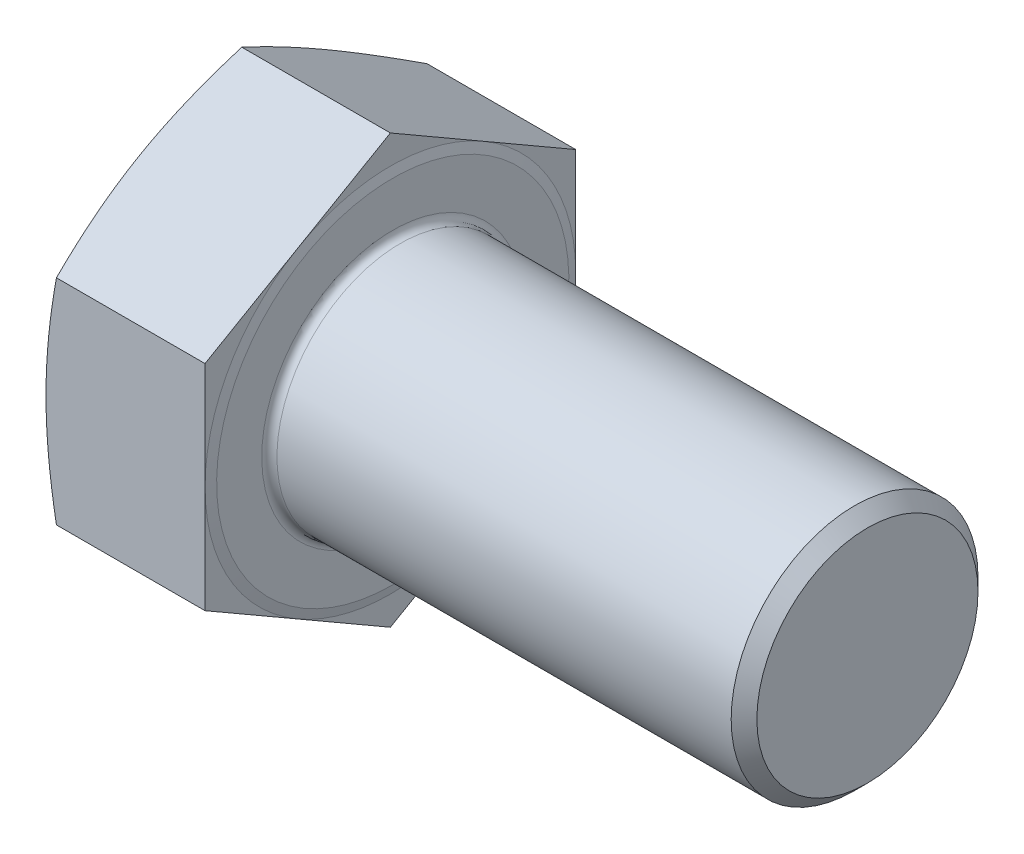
from build123d import *

# Parameters (mm, degrees)
BASEHEAD_DEPTH = 33.5
SKETCH3_R      = 26
BASEBODY_DEPTH = 100
CHAMFER1_SIZE  = 2.7065
HEADFILLET_R   = 1.6


with BuildPart() as part:
    # Sketch-BaseHead → BaseHead (new body)
    with BuildSketch(Plane(origin=(0, 0, 0), x_dir=(0, 0, -1), z_dir=(1, 0, 0))):
        Polygon((0, -45.091056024), (39.05, -22.545528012), (39.05, 22.545528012), (0, 45.091056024), (-39.05, 22.545528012), (-39.05, -22.545528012), align=None)
    extrude(amount=BASEHEAD_DEPTH)

    # Sketch4 → HeadChamfer (revolve, cut)
    with BuildSketch(Plane(origin=(-0.264637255, -5.916896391, 0), x_dir=(0, 1, 0), z_dir=(0, 0, 1))):
        Polygon((51.007952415, -0.264637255), (44.966896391, -0.264637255), (51.007952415, -2.463401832), align=None)
    revolve(axis=Axis((-4.001564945, 0, 0), (1, 0, 0)), mode=Mode.SUBTRACT)

    # Sketch1 → Revolve1 (revolve)
    with BuildSketch(Plane(origin=(0, 0, 0), x_dir=(1, 0, 0), z_dir=(0, 1, 0)), mode=Mode.PRIVATE) as revolve1_sk:
        Polygon((33.5, 0), (34, 0), (34, 37.1), (33.5, 39.05), align=None)
    revolve(revolve1_sk.sketch.rotate(Axis((-4.001564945, 0, 0), (1, 0, 0)), 270), axis=Axis((-4.001564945, 0, 0), (1, 0, 0)))

    # Sketch3 → BaseBody (add)
    with BuildSketch(Plane(origin=(34, 0, 0), x_dir=(0, 0, -1), z_dir=(1, 0, 0))):
        with Locations(Location((0, 0, 0), (0, 0, 270))):
            Circle(SKETCH3_R)
    extrude(amount=BASEBODY_DEPTH)

    # Chamfer1
    chamfer1_edges = [part.edges().sort_by_distance(p)[0] for p in [
        (134, 26, 0),
    ]]
    chamfer(chamfer1_edges, length=CHAMFER1_SIZE)

    # HeadFillet
    headfillet_edges = [part.edges().sort_by_distance(p)[0] for p in [
        (34, 26, 0),
    ]]
    fillet(headfillet_edges, radius=HEADFILLET_R)


solid = part.part
